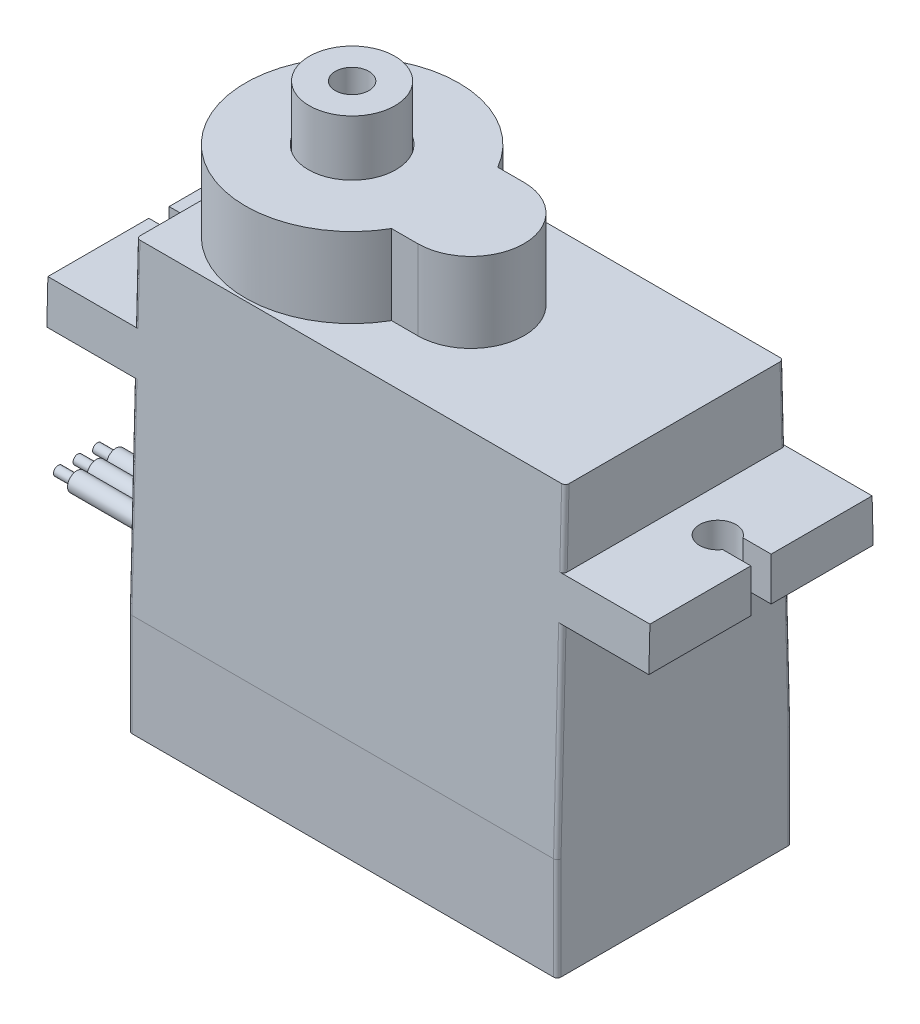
from build123d import *

# Parameters (mm, degrees)
BOSS_EXTRUDE1_DEPTH      = 6.295
BOSS_EXTRUDE2_DEPTH      = 4.28
CUT_EXTRUDE4_DEPTH       = 37.749948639
SKETCH4_R                = 0.975
SKETCH4_W                = 1.511544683
SKETCH4_H                = 1.09
CUT_EXTRUDE1_DEPTH       = 27.991002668
SKETCH5_R                = 1
SKETCH5_R_2              = 0.975
CUT_EXTRUDE2_DEPTH       = 1
SKETCH6_R                = 0.5
BOSS_EXTRUDE4_DEPTH      = 8
SKETCH7_R                = 0.25
BOSS_EXTRUDE5_DEPTH      = 1
FILLET1_R                = 0.3
FILLET3_R                = 0.2
BOSS_EXTRUDE6_DEPTH      = 2.95
BOSS_EXTRUDE6_DEPTH_BACK = 1
SKETCH12_R               = 2.3
SKETCH12_R_2             = 0.9
SKETCH13_R               = 2.35
CUT_EXTRUDE5_DEPTH       = 5


with BuildPart() as part:
    # Sketch1 → Boss-Extrude1 (new, symmetric)
    with BuildSketch(Plane.XY):
        Polygon((-7.13, 6.38), (15.9, 6.38), (15.9, 2.32), (20.54, 2.32), (20.54, 0), (15.9, 0), (15.9, -16.34), (-7.13, -16.34), (-7.13, 0), (-11.77, 0), (-11.77, 2.32), (-7.13, 2.32), align=None)
    extrude(amount=BOSS_EXTRUDE1_DEPTH, both=True)

    # Sketch2 → Boss-Extrude2 (add)
    with BuildSketch(Plane(origin=(0, 6.38, 0), x_dir=(1, 0, 0), z_dir=(0, 1, 0))):
        with BuildLine():
            Line((3.560191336, -2.85), (4.97, -2.85))
            ThreePointArc((4.97, -2.85), (7.82, 0), (4.97, 2.85))
            Line((4.97, 2.85), (3.560191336, 2.85))
            ThreePointArc((3.560191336, 2.85), (-7.13, 0), (3.560191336, -2.85))
        make_face()
    extrude(amount=BOSS_EXTRUDE2_DEPTH)

    # Sketch11 → Cut-Extrude4 (cut, through all)
    with BuildSketch(Plane.ZY.offset(11.77)):
        Polygon((-5.86, 6.38), (-6.295, -10.84), (-6.295, 6.38), align=None)
    cut_extrude4 = extrude(amount=-CUT_EXTRUDE4_DEPTH, mode=Mode.SUBTRACT)

    # Mirror1: Cut-Extrude4 across plane
    add(cut_extrude4.mirror(Plane.XY), mode=Mode.SUBTRACT)

    # Sketch4 → Cut-Extrude1 (cut, through all)
    with BuildSketch(Plane(origin=(0, 0, 0), x_dir=(1, 0, 0), z_dir=(0, 1, 0))):
        with Locations((-9.45, 0)):
            Circle(SKETCH4_R)
        with Locations((-11.014227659, 0)):
            Rectangle(SKETCH4_W, SKETCH4_H)
    cut_extrude1 = extrude(amount=CUT_EXTRUDE1_DEPTH, mode=Mode.SUBTRACT)

    # Mirror2: Cut-Extrude1 across plane
    add(cut_extrude1.mirror(Plane(origin=(4.385, -10.84, 6.295), x_dir=(0, 0, 1), z_dir=(-1, 0, 0))), mode=Mode.SUBTRACT)

    # Sketch5 → Cut-Extrude2 (cut)
    # profile 1 of 4: a face of its own
    with BuildSketch(Plane.XZ.offset(16.34)):
        with Locations(Location((-5.49, 4.35, 0), (0, 0, 270))):
            Circle(SKETCH5_R)
        with Locations(Location((-5.49, 4.35, 0), (0, 0, 270))):
            Circle(SKETCH5_R_2, mode=Mode.SUBTRACT)
    # profile 2 of 4: a face of its own
    with BuildSketch(Plane.XZ.offset(16.34)):
        with Locations(Location((-5.49, -4.35, 0), (0, 0, 270))):
            Circle(SKETCH5_R)
        with Locations(Location((-5.49, -4.35, 0), (0, 0, 270))):
            Circle(SKETCH5_R_2, mode=Mode.SUBTRACT)
    # profile 3 of 4: a face of its own
    with BuildSketch(Plane.XZ.offset(16.34)):
        with Locations(Location((14.26, -4.35, 0), (0, 0, 270))):
            Circle(SKETCH5_R)
        with Locations(Location((14.26, -4.35, 0), (0, 0, 270))):
            Circle(SKETCH5_R_2, mode=Mode.SUBTRACT)
    # profile 4 of 4: a face of its own
    with BuildSketch(Plane.XZ.offset(16.34)):
        with Locations(Location((14.26, 4.35, 0), (0, 0, 270))):
            Circle(SKETCH5_R)
        with Locations(Location((14.26, 4.35, 0), (0, 0, 270))):
            Circle(SKETCH5_R_2, mode=Mode.SUBTRACT)
    extrude(amount=-CUT_EXTRUDE2_DEPTH, mode=Mode.SUBTRACT)

    # Sketch6 → Boss-Extrude4 (add)
    with BuildSketch(Plane.ZY.offset(7.13)):
        with Locations(Location((0, -11.34, 0), (0, 0, 180))):
            Circle(SKETCH6_R)
        with Locations(Location((1.05, -11.34, 0), (0, 0, 180))):
            Circle(SKETCH6_R)
        with Locations(Location((-1.05, -11.34, 0), (0, 0, 180))):
            Circle(SKETCH6_R)
    extrude(amount=BOSS_EXTRUDE4_DEPTH)

    # Sketch7 → Boss-Extrude5 (add)
    with BuildSketch(Plane.ZY.offset(15.13)):
        with Locations(Location((0, -11.34, 0), (0, 0, 270))):
            Circle(SKETCH7_R)
        with Locations(Location((1.05, -11.34, 0), (0, 0, 270))):
            Circle(SKETCH7_R)
        with Locations(Location((-1.05, -11.34, 0), (0, 0, 270))):
            Circle(SKETCH7_R)
    extrude(amount=BOSS_EXTRUDE5_DEPTH)

    # Fillet1
    fillet1_edges = [part.edges().sort_by_distance(p)[0] for p in [
        (-5.49, -16.34, 5.325),
        (-5.49, -16.34, -3.375),
        (14.26, -16.34, -3.375),
        (14.26, -16.34, 5.325),
    ]]
    fillet(fillet1_edges, radius=FILLET1_R)

    # Fillet3
    fillet3_edges = [part.edges().sort_by_distance(p)[0] for p in [
        (15.9, -13.59, -6.295),
        (15.9, -13.59, 6.295),
        (-7.13, -13.59, -6.295),
        (-7.13, 4.35, -5.911280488),
        (-7.13, -5.42, -6.158083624),
        (15.9, -5.42, -6.158083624),
        (15.9, 4.35, -5.911280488),
        (-7.13, -13.59, 6.295),
        (-7.13, 4.35, 5.911280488),
        (-7.13, -5.42, 6.158083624),
        (15.9, -5.42, 6.158083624),
        (15.9, 4.35, 5.911280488),
    ]]
    fillet(fillet3_edges, radius=FILLET3_R)

    # Sketch13 → Cut-Extrude5 (cut)
    with BuildSketch(Plane(origin=(0, 13.61, 0), x_dir=(1, 0, 0), z_dir=(0, 1, 0))):
        with Locations(Location((-1.405, 0, 0), (0, 0, 270))):
            Circle(SKETCH13_R)
    extrude(amount=-CUT_EXTRUDE5_DEPTH, mode=Mode.SUBTRACT)


with BuildPart() as body_2:
    # Sketch12 → Boss-Extrude6 (new, two sides: drawn at the far end of the back side and taken through both)
    with BuildSketch(Plane(origin=(0, 10.66, 0), x_dir=(1, 0, 0), z_dir=(0, 1, 0)).offset(-BOSS_EXTRUDE6_DEPTH_BACK)):
        with Locations(Location((-1.405, 0, 0), (0, 0, 270))):
            Circle(SKETCH12_R)
        with Locations(Location((-1.405, 0, 0), (0, 0, 270))):
            Circle(SKETCH12_R_2, mode=Mode.SUBTRACT)
    extrude(amount=BOSS_EXTRUDE6_DEPTH + BOSS_EXTRUDE6_DEPTH_BACK)


solid = Compound([part.part, body_2.part])
